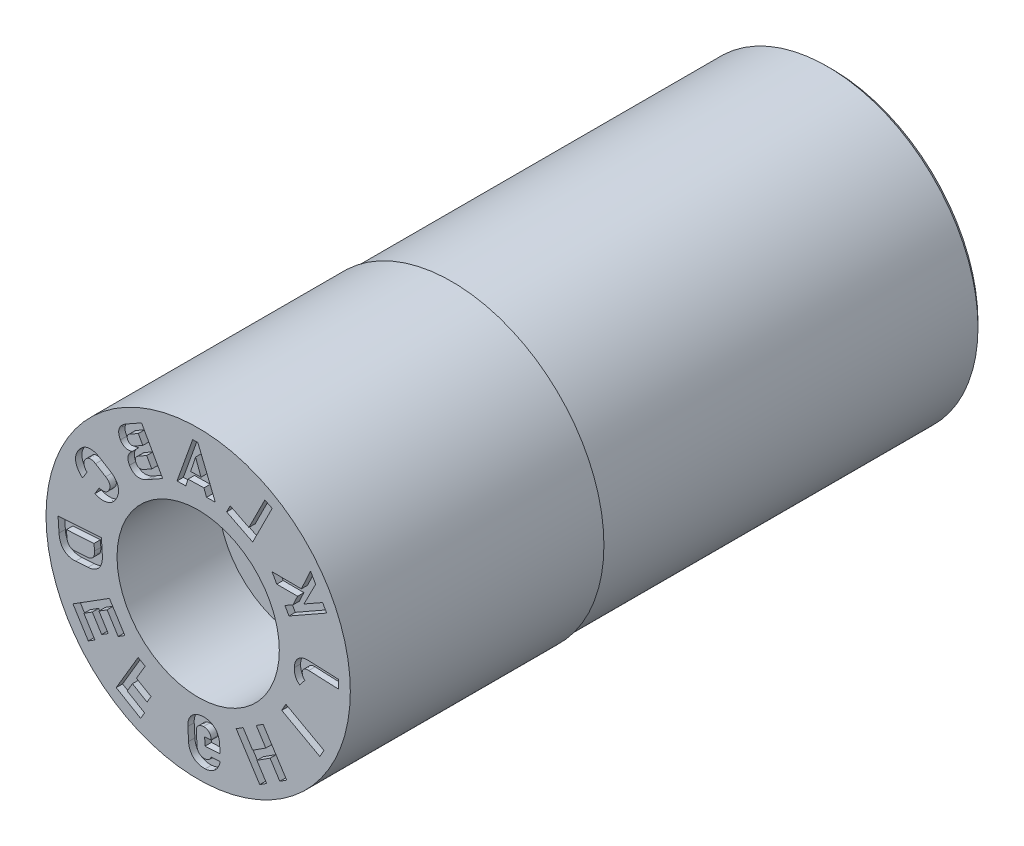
from build123d import *

# Parameters (mm, degrees)
SKETCH4_W          = 15
SKETCH4_H          = 1
CUT_EXTRUDE1_DEPTH = 0.25
CUT_EXTRUDE2_DEPTH = 3


with BuildPart() as part:
    # Sketch1 → Revolve1 (revolve)
    with BuildSketch(Plane(origin=(0, 0, 0), x_dir=(0, 0, -1), z_dir=(1, 0, 0)), mode=Mode.PRIVATE) as revolve1_sk:
        Polygon((0, 6), (0, 3.2), (4, 3.2), (4, 1.5), (19, 1.5), (19, 3), (25, 3), (25, 5.75), (24.75, 6), align=None)
    revolve(revolve1_sk.sketch.rotate(Axis((0, 0, 3.797909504), (0, 0, -1)), 90), axis=Axis((0, 0, 3.797909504), (0, 0, -1)))

    # Sketch4 → Cut-Revolve1 (revolve, cut)
    with BuildSketch(Plane(origin=(0, 0, 0), x_dir=(0, 0, -1), z_dir=(1, 0, 0)), mode=Mode.PRIVATE) as cut_revolve1_sk:
        with Locations((17.5, 6.435)):
            Rectangle(SKETCH4_W, SKETCH4_H)
    revolve(cut_revolve1_sk.sketch.rotate(Axis((0, 0, 0), (0, 0, -1)), 90), axis=Axis((0, 0, 0), (0, 0, -1)), mode=Mode.SUBTRACT)

    # Sketch2 → Cut-Extrude1 (cut)
    # profile 1 of 12: a face of its own
    with BuildSketch(Plane.XY):
        Polygon((4.171235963, 2.072474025), (4.632670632, 2.974470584), (4.432443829, 3.327050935), (4.068977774, 2.537599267), (2.91142221, 2.546631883), (3.099758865, 2.214166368), (3.918409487, 2.21056354), (3.742976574, 1.829521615), (3.421460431, 1.647124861), (3.580399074, 1.367185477), (5.066226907, 2.210098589), (4.907288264, 2.490037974), align=None)
    # profile 2 of 12: a face of its own
    with BuildSketch(Plane.XY):
        Polygon((2.919004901, 4.711078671), (2.629838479, 4.85616005), (2.000295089, 3.60091463), (1.262058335, 3.971177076), (1.122497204, 3.6926532), (2.149778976, 3.177320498), align=None)
    # profile 3 of 12: a face of its own
    with BuildSketch(Plane.XY):
        Polygon((-0.012626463, 5.495535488), (-0.216968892, 5.491201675), (-0.834872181, 3.76941146), (-0.488146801, 3.776648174), (-0.397957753, 4.052405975), (0.227855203, 4.065529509), (0.329584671, 3.793649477), (0.675962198, 3.80087229), align=None)
        Polygon((-0.103783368, 4.951859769), (0.112650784, 4.373422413), (-0.295767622, 4.364857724), align=None, mode=Mode.SUBTRACT)
    # profile 4 of 12: a face of its own
    with BuildSketch(Plane.XY):
        Polygon((-3.912099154, -2.210259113), (-3.589235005, -2.007294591), (-3.153470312, -2.70083517), (-2.891846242, -2.536452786), (-3.498099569, -1.571355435), (-4.938180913, -2.476644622), (-4.331927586, -3.441741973), (-4.070617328, -3.277208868), (-4.506301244, -2.583796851), (-4.173528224, -2.37460324), (-3.806145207, -2.95894143), (-3.544834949, -2.794408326), align=None)
    # profile 5 of 12: a face of its own
    with BuildSketch(Plane.XY):
        Polygon((-2.433475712, -3.764764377), (-2.089649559, -3.183480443), (-2.36563311, -3.020190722), (-3.231696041, -4.48438553), (-2.270028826, -5.05345174), (-2.112675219, -4.787761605), (-2.798554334, -4.381978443), (-2.590681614, -4.030541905), (-2.016031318, -4.370545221), (-1.85867771, -4.104855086), align=None)
    # profile 6 of 12: a face of its own
    with BuildSketch(Plane.XY):
        with BuildLine():
            Line((-2.231548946, 5.054885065), (-2.836814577, 4.715702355))
            add(Edge.make_bspline(
                [(-2.836814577, 4.715702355), (-2.881527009, 4.690780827), (-2.943919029, 4.649369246), (-3.014037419, 4.583020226), (-3.05637001, 4.532175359), (-3.090164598, 4.478758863), (-3.114796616, 4.423004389), (-3.129549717, 4.36504164), (-3.135593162, 4.305569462), (-3.131871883, 4.24461235), (-3.11476101, 4.15981132), (-3.087566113, 4.098808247), (-3.065583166, 4.059438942)],
                knots=[0, 0, 0, 0, 0.19478614, 0.282854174, 0.366198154, 0.445691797, 0.522430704, 0.596919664, 0.672178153, 0.748788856, 0.82822861, 1, 1, 1, 1], degree=3))
            add(Edge.make_bspline(
                [(-3.065583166, 4.059438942), (-3.049920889, 4.032193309), (-3.023998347, 3.99334859), (-2.980572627, 3.950707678), (-2.946117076, 3.924223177), (-2.90902032, 3.902816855), (-2.869576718, 3.886323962), (-2.827673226, 3.875808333), (-2.783939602, 3.869793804), (-2.73843244, 3.869502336), (-2.674271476, 3.876006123), (-2.626536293, 3.889389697), (-2.59493338, 3.900678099)],
                knots=[0, 0, 0, 0, 0.172796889, 0.253867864, 0.332914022, 0.410581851, 0.488200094, 0.566646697, 0.646913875, 0.729830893, 0.815675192, 1, 1, 1, 1], degree=3))
            add(Edge.make_bspline(
                [(-2.59493338, 3.900678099), (-2.623243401, 3.878917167), (-2.66312319, 3.844198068), (-2.704949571, 3.789627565), (-2.729933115, 3.747790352), (-2.749312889, 3.704323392), (-2.761626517, 3.659124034), (-2.76879309, 3.613088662), (-2.768488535, 3.565896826), (-2.762810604, 3.518029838), (-2.746096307, 3.452040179), (-2.724600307, 3.404453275), (-2.707211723, 3.373664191)],
                knots=[0, 0, 0, 0, 0.180057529, 0.263783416, 0.344958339, 0.424782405, 0.502382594, 0.580015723, 0.658446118, 0.739020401, 0.822028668, 1, 1, 1, 1], degree=3))
            Line((-2.707211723, 3.373664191), (-2.705647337, 3.370776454))
            add(Edge.make_bspline(
                [(-2.705647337, 3.370776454), (-2.683492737, 3.330814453), (-2.644963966, 3.275577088), (-2.581245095, 3.215719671), (-2.530512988, 3.18098542), (-2.476392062, 3.154440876), (-2.418734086, 3.137437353), (-2.358072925, 3.128888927), (-2.294584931, 3.129834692), (-2.228811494, 3.13936196), (-2.135617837, 3.165293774), (-2.067543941, 3.196577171), (-2.022928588, 3.221852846)],
                knots=[0, 0, 0, 0, 0.172848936, 0.252223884, 0.329273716, 0.404442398, 0.47914627, 0.55555657, 0.635161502, 0.718343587, 0.806128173, 1, 1, 1, 1], degree=3))
            Line((-2.022928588, 3.221852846), (-1.899889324, 3.290704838))
            Line((-1.899889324, 3.290704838), (-1.400164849, 3.570724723))
            Line((-1.400164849, 3.570724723), (-2.231548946, 5.054885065))
        make_face()
        with BuildLine():
            Line((-2.360287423, 4.628554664), (-2.181801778, 4.30992779))
            Line((-2.181801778, 4.30992779), (-2.498183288, 4.132759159))
            add(Edge.make_bspline(
                [(-2.498183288, 4.132759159), (-2.524319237, 4.119168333), (-2.564049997, 4.100617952), (-2.619427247, 4.096064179), (-2.657096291, 4.100369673), (-2.691999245, 4.113509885), (-2.736299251, 4.141648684), (-2.759911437, 4.175282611), (-2.773813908, 4.198572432)],
                knots=[0, 0, 0, 0, 0.277832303, 0.398607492, 0.514671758, 0.628814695, 0.743812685, 1, 1, 1, 1], degree=3))
            add(Edge.make_bspline(
                [(-2.773813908, 4.198572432), (-2.785815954, 4.220152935), (-2.799192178, 4.255079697), (-2.7983897, 4.303351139), (-2.789523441, 4.337520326), (-2.772527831, 4.369965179), (-2.73759582, 4.412250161), (-2.702543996, 4.437314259), (-2.676444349, 4.451511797)],
                knots=[0, 0, 0, 0, 0.243005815, 0.354161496, 0.466965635, 0.585007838, 0.709189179, 1, 1, 1, 1], degree=3))
            Line((-2.676444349, 4.451511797), (-2.360287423, 4.628554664))
        make_face(mode=Mode.SUBTRACT)
        with BuildLine():
            Line((-2.030890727, 4.040526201), (-1.830813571, 3.683354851))
            Line((-1.830813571, 3.683354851), (-2.147010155, 3.506289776))
            add(Edge.make_bspline(
                [(-2.147010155, 3.506289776), (-2.175901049, 3.491030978), (-2.219736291, 3.470925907), (-2.280467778, 3.464191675), (-2.321495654, 3.467907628), (-2.359493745, 3.480937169), (-2.406814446, 3.510485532), (-2.43265518, 3.545375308), (-2.446901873, 3.570249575)],
                knots=[0, 0, 0, 0, 0.283986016, 0.407341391, 0.52341818, 0.636508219, 0.750740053, 1, 1, 1, 1], degree=3))
            Line((-2.446901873, 3.570249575), (-2.448769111, 3.573308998))
            add(Edge.make_bspline(
                [(-2.448769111, 3.573308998), (-2.458678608, 3.590738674), (-2.470638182, 3.617780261), (-2.478355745, 3.655348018), (-2.479558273, 3.682171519), (-2.477062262, 3.708457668), (-2.470118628, 3.733882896), (-2.459410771, 3.758689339), (-2.444183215, 3.782263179), (-2.425316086, 3.804679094), (-2.394663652, 3.83443419), (-2.366589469, 3.852020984), (-2.347122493, 3.863441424)],
                knots=[0, 0, 0, 0, 0.172485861, 0.251675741, 0.32832506, 0.402454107, 0.477688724, 0.553908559, 0.633798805, 0.717922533, 0.805334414, 1, 1, 1, 1], degree=3))
            Line((-2.347122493, 3.863441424), (-2.030890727, 4.040526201))
        make_face(mode=Mode.SUBTRACT)
    # profile 7 of 12: a face of its own
    with BuildSketch(Plane.XY):
        Polygon((2.835349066, -3.861352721), (3.219001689, -4.458125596), (3.490828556, -4.28345078), (2.562903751, -2.840060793), (2.291076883, -3.014735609), (2.666885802, -3.599307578), (2.14862657, -3.932611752), (1.772751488, -3.347936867), (1.500461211, -3.52277794), (2.428386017, -4.966167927), (2.700676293, -4.791326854), (2.317089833, -4.194656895), align=None)
    # profile 8 of 12: a face of its own
    with BuildSketch(Plane.XY):
        with BuildLine():
            Line((-3.471225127, 2.792993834), (-3.872326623, 3.038529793))
            add(Edge.make_bspline(
                [(-3.872326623, 3.038529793), (-3.900080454, 3.055588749), (-3.942126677, 3.07898249), (-3.999518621, 3.105050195), (-4.04143091, 3.121388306), (-4.083057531, 3.134466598), (-4.12405598, 3.145669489), (-4.164883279, 3.152760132), (-4.205149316, 3.157508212), (-4.244897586, 3.159064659), (-4.284052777, 3.157887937), (-4.322537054, 3.154046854), (-4.360103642, 3.14682495), (-4.397019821, 3.137129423), (-4.433077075, 3.124424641), (-4.46866534, 3.109129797), (-4.503184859, 3.090499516), (-4.536971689, 3.069280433), (-4.569831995, 3.045451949), (-4.601482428, 3.018613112), (-4.631868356, 2.988801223), (-4.661326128, 2.956541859), (-4.699735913, 2.90902197), (-4.725843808, 2.870463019), (-4.742315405, 2.843527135)],
                knots=[0, 0, 0, 0, 0.096418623, 0.142170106, 0.186461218, 0.229442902, 0.271254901, 0.31212696, 0.351940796, 0.391171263, 0.429722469, 0.467793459, 0.505489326, 0.542812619, 0.580645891, 0.618521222, 0.657328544, 0.696599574, 0.736521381, 0.777345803, 0.819284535, 0.86241413, 0.906559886, 1, 1, 1, 1], degree=3))
            add(Edge.make_bspline(
                [(-4.742315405, 2.843527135), (-4.768682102, 2.79959471), (-4.802372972, 2.730938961), (-4.826695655, 2.633739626), (-4.835117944, 2.561452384), (-4.83396412, 2.488897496), (-4.823091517, 2.416648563), (-4.802083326, 2.345162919), (-4.771658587, 2.27457113), (-4.732103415, 2.20513599), (-4.664980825, 2.11260884), (-4.603115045, 2.050098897), (-4.558114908, 2.010712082)],
                knots=[0, 0, 0, 0, 0.164359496, 0.242522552, 0.319818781, 0.396757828, 0.474196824, 0.553044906, 0.634665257, 0.71980849, 0.808406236, 1, 1, 1, 1], degree=3))
            Line((-4.558114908, 2.010712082), (-4.383189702, 2.296693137))
            add(Edge.make_bspline(
                [(-4.383189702, 2.296693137), (-4.402545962, 2.31603803), (-4.430501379, 2.34537888), (-4.459626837, 2.389116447), (-4.477181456, 2.421419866), (-4.49005486, 2.45411298), (-4.500073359, 2.486532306), (-4.504572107, 2.519208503), (-4.505778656, 2.551509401), (-4.50296545, 2.583551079), (-4.492117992, 2.625877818), (-4.478612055, 2.656117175), (-4.466727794, 2.674951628)],
                knots=[0, 0, 0, 0, 0.195176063, 0.286539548, 0.373239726, 0.456219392, 0.536212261, 0.614027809, 0.690102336, 0.765907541, 0.841950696, 1, 1, 1, 1], degree=3))
            add(Edge.make_bspline(
                [(-4.466727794, 2.674951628), (-4.4522102, 2.699184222), (-4.42697976, 2.73215298), (-4.386619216, 2.767672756), (-4.355160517, 2.788289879), (-4.321508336, 2.803057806), (-4.286104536, 2.812374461), (-4.248970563, 2.816242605), (-4.210263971, 2.814805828), (-4.17055541, 2.807107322), (-4.114128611, 2.79050131), (-4.073900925, 2.768745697), (-4.047104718, 2.753018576)],
                knots=[0, 0, 0, 0, 0.174815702, 0.254583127, 0.331751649, 0.406600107, 0.480982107, 0.557388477, 0.636835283, 0.719715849, 0.807055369, 1, 1, 1, 1], degree=3))
            Line((-4.047104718, 2.753018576), (-3.646003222, 2.507482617))
            add(Edge.make_bspline(
                [(-3.646003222, 2.507482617), (-3.619463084, 2.49133468), (-3.582727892, 2.464471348), (-3.541581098, 2.422643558), (-3.51709236, 2.390569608), (-3.498216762, 2.357029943), (-3.48514265, 2.32215893), (-3.47753314, 2.28639686), (-3.475421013, 2.249668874), (-3.479206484, 2.212216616), (-3.492499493, 2.16001244), (-3.510957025, 2.122741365), (-3.525622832, 2.098600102)],
                knots=[0, 0, 0, 0, 0.192501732, 0.280291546, 0.362663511, 0.441768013, 0.517825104, 0.592476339, 0.667438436, 0.744799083, 0.824735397, 1, 1, 1, 1], degree=3))
            add(Edge.make_bspline(
                [(-3.525622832, 2.098600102), (-3.537547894, 2.079481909), (-3.557755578, 2.052569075), (-3.591275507, 2.023808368), (-3.618318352, 2.006052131), (-3.647681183, 1.992120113), (-3.678728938, 1.980984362), (-3.712015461, 1.975201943), (-3.746888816, 1.972289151), (-3.783420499, 1.973161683), (-3.835569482, 1.980396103), (-3.874446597, 1.991835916), (-3.900511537, 2.001109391)],
                knots=[0, 0, 0, 0, 0.160080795, 0.236116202, 0.312169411, 0.388723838, 0.466100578, 0.545220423, 0.627432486, 0.713976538, 0.803688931, 1, 1, 1, 1], degree=3))
            Line((-3.900511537, 2.001109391), (-4.075436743, 1.715128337))
            add(Edge.make_bspline(
                [(-4.075436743, 1.715128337), (-4.019537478, 1.693589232), (-3.935631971, 1.666969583), (-3.822590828, 1.649418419), (-3.74279981, 1.645903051), (-3.666092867, 1.650542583), (-3.593104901, 1.664474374), (-3.524008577, 1.687476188), (-3.459089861, 1.71915191), (-3.398249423, 1.759084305), (-3.323335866, 1.825515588), (-3.276543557, 1.885870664), (-3.249873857, 1.929716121)],
                knots=[0, 0, 0, 0, 0.192101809, 0.280672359, 0.365807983, 0.447541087, 0.526353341, 0.603189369, 0.680187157, 0.757177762, 0.835634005, 1, 1, 1, 1], degree=3))
            add(Edge.make_bspline(
                [(-3.249873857, 1.929716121), (-3.233538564, 1.956685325), (-3.210657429, 1.997381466), (-3.186343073, 2.053404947), (-3.170759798, 2.094241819), (-3.158425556, 2.134828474), (-3.148453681, 2.175079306), (-3.141951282, 2.215095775), (-3.138218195, 2.254813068), (-3.137667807, 2.293958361), (-3.139378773, 2.332519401), (-3.144744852, 2.370421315), (-3.15289797, 2.407673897), (-3.163733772, 2.444408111), (-3.177546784, 2.480397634), (-3.194014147, 2.515908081), (-3.213865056, 2.550423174), (-3.236167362, 2.584344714), (-3.261701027, 2.617018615), (-3.289836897, 2.64885442), (-3.320503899, 2.679803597), (-3.354002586, 2.709786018), (-3.403487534, 2.748855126), (-3.443106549, 2.776313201), (-3.471225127, 2.792993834)],
                knots=[0, 0, 0, 0, 0.093394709, 0.137866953, 0.180684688, 0.222705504, 0.263356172, 0.303339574, 0.342594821, 0.381331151, 0.419141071, 0.456735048, 0.494484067, 0.531939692, 0.569987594, 0.608497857, 0.6476809, 0.687739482, 0.728571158, 0.770310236, 0.813445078, 0.857467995, 0.903296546, 1, 1, 1, 1], degree=3))
        make_face()
    # profile 9 of 12: a face of its own
    with BuildSketch(Plane.XY):
        with BuildLine():
            Line((-4.830560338, -0.965853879), (-4.346314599, -0.933772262))
            add(Edge.make_bspline(
                [(-4.346314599, -0.933772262), (-4.316564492, -0.931691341), (-4.272596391, -0.926677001), (-4.215783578, -0.914612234), (-4.175145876, -0.904377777), (-4.136556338, -0.890383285), (-4.099205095, -0.875119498), (-4.063550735, -0.857322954), (-4.029608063, -0.837308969), (-3.997297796, -0.81520365), (-3.967203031, -0.790382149), (-3.939265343, -0.7633564), (-3.91274156, -0.734666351), (-3.889598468, -0.702735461), (-3.86739448, -0.669445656), (-3.847965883, -0.633405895), (-3.830143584, -0.595401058), (-3.814920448, -0.555025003), (-3.801825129, -0.512887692), (-3.791469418, -0.468802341), (-3.784008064, -0.422695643), (-3.778850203, -0.374523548), (-3.775022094, -0.306432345), (-3.776479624, -0.254329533), (-3.778985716, -0.219158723)],
                knots=[0, 0, 0, 0, 0.086430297, 0.127888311, 0.168207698, 0.207698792, 0.246675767, 0.285052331, 0.323012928, 0.360748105, 0.398340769, 0.435858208, 0.473304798, 0.511339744, 0.549952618, 0.589150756, 0.629809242, 0.671473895, 0.714040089, 0.757555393, 0.802536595, 0.849254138, 0.897843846, 1, 1, 1, 1], degree=3))
            Line((-3.778985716, -0.219158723), (-3.816054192, 0.344847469))
            Line((-3.816054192, 0.344847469), (-5.524383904, 0.232175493))
            Line((-5.524383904, 0.232175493), (-5.487177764, -0.332865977))
            add(Edge.make_bspline(
                [(-5.487177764, -0.332865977), (-5.484987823, -0.367281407), (-5.479590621, -0.417919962), (-5.467663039, -0.483495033), (-5.456504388, -0.529577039), (-5.443776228, -0.573651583), (-5.428675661, -0.615621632), (-5.411560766, -0.655515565), (-5.391956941, -0.693031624), (-5.371035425, -0.728604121), (-5.347345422, -0.761376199), (-5.322462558, -0.792299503), (-5.294832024, -0.820251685), (-5.265946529, -0.846361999), (-5.234855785, -0.869671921), (-5.202097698, -0.89080954), (-5.167242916, -0.909274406), (-5.130732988, -0.925478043), (-5.092560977, -0.939165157), (-5.052748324, -0.94984932), (-5.011444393, -0.958585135), (-4.968404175, -0.964385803), (-4.90793032, -0.968661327), (-4.861712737, -0.967627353), (-4.830560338, -0.965853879)],
                knots=[0, 0, 0, 0, 0.099740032, 0.147123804, 0.192678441, 0.236825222, 0.279748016, 0.321610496, 0.362273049, 0.402114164, 0.440851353, 0.479133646, 0.516792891, 0.554399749, 0.591662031, 0.629051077, 0.667054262, 0.705622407, 0.744501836, 0.784211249, 0.824761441, 0.866533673, 0.909715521, 1, 1, 1, 1], degree=3))
        make_face()
        with BuildLine():
            Line((-4.104983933, 0.002370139), (-4.088414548, -0.248012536))
            add(Edge.make_bspline(
                [(-4.088414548, -0.248012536), (-4.087089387, -0.27299956), (-4.086187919, -0.309680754), (-4.091667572, -0.356970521), (-4.097787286, -0.389417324), (-4.106323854, -0.419937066), (-4.11769528, -0.448333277), (-4.131876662, -0.474511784), (-4.148400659, -0.498663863), (-4.167288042, -0.520353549), (-4.187967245, -0.540027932), (-4.211344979, -0.556377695), (-4.236680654, -0.570356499), (-4.264253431, -0.581782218), (-4.304863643, -0.593736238), (-4.337060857, -0.598604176), (-4.359125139, -0.599733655)],
                knots=[0, 0, 0, 0, 0.149070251, 0.217385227, 0.282879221, 0.345337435, 0.405621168, 0.464448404, 0.522126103, 0.579343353, 0.635280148, 0.691484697, 0.748535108, 0.807147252, 0.868663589, 1, 1, 1, 1], degree=3))
            Line((-4.359125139, -0.599733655), (-4.86218944, -0.632912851))
            add(Edge.make_bspline(
                [(-4.86218944, -0.632912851), (-4.884177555, -0.63441477), (-4.916821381, -0.634467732), (-4.958517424, -0.627204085), (-4.987595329, -0.620235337), (-5.01430721, -0.608964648), (-5.039629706, -0.595881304), (-5.06300877, -0.579457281), (-5.084413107, -0.560174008), (-5.103999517, -0.538512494), (-5.120811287, -0.514027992), (-5.136140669, -0.487645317), (-5.148597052, -0.458489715), (-5.159185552, -0.427266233), (-5.169789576, -0.38090437), (-5.175082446, -0.34472264), (-5.176374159, -0.319633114)],
                knots=[0, 0, 0, 0, 0.131403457, 0.192788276, 0.251650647, 0.308869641, 0.364824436, 0.421034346, 0.478336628, 0.535991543, 0.594369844, 0.654771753, 0.717284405, 0.782701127, 0.850730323, 1, 1, 1, 1], degree=3))
            Line((-5.176374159, -0.319633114), (-5.192934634, -0.06938507))
            Line((-5.192934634, -0.06938507), (-4.104983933, 0.002370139))
        make_face(mode=Mode.SUBTRACT)
    # profile 10 of 12: a face of its own
    with BuildSketch(Plane.XY):
        with BuildLine():
            Line((0.863629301, -4.699665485), (0.845775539, -4.365965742))
            add(Edge.make_bspline(
                [(0.845775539, -4.365965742), (0.843665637, -4.335186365), (0.839692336, -4.289574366), (0.82812439, -4.230529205), (0.817373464, -4.18836289), (0.804353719, -4.147680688), (0.788984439, -4.108514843), (0.771320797, -4.070965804), (0.751333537, -4.035058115), (0.729258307, -4.000935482), (0.704942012, -3.969022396), (0.679409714, -3.938698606), (0.651377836, -3.911058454), (0.6215905, -3.885483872), (0.589758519, -3.862462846), (0.556516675, -3.840888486), (0.521062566, -3.822177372), (0.484201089, -3.80547175), (0.445913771, -3.79122108), (0.406236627, -3.77989069), (0.365487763, -3.770356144), (0.323318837, -3.764036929), (0.264750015, -3.759092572), (0.220061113, -3.758411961), (0.189992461, -3.760439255)],
                knots=[0, 0, 0, 0, 0.092114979, 0.136277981, 0.1793654, 0.221873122, 0.26362554, 0.304798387, 0.345574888, 0.386143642, 0.42592481, 0.465205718, 0.504301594, 0.543231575, 0.582216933, 0.621416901, 0.66136043, 0.701681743, 0.742093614, 0.783108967, 0.824710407, 0.866861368, 0.910181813, 1, 1, 1, 1], degree=3))
            add(Edge.make_bspline(
                [(0.189992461, -3.760439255), (0.15979978, -3.762527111), (0.114967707, -3.766323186), (0.057022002, -3.77795615), (0.015576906, -3.788109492), (-0.024292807, -3.800834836), (-0.062711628, -3.815701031), (-0.099676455, -3.833044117), (-0.135045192, -3.852508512), (-0.168725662, -3.873989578), (-0.200295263, -3.897348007), (-0.229894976, -3.922271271), (-0.257213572, -3.949249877), (-0.28224657, -3.978211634), (-0.305149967, -4.008971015), (-0.326482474, -4.041145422), (-0.344820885, -4.075476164), (-0.361575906, -4.11103179), (-0.375213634, -4.148196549), (-0.387160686, -4.186336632), (-0.395624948, -4.225904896), (-0.40245796, -4.266400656), (-0.40699981, -4.323046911), (-0.407428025, -4.366183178), (-0.405679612, -4.395323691)],
                knots=[0, 0, 0, 0, 0.092698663, 0.137285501, 0.180720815, 0.223200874, 0.265242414, 0.306681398, 0.34803511, 0.388686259, 0.428814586, 0.468112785, 0.50698522, 0.546164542, 0.585119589, 0.624268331, 0.664152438, 0.704099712, 0.744433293, 0.78518356, 0.826278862, 0.86813407, 0.910753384, 1, 1, 1, 1], degree=3))
            Line((-0.405679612, -4.395323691), (-0.378924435, -4.899198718))
            add(Edge.make_bspline(
                [(-0.378924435, -4.899198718), (-0.376814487, -4.929978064), (-0.372841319, -4.975590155), (-0.361273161, -5.034635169), (-0.350522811, -5.076801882), (-0.337500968, -5.117482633), (-0.322139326, -5.156653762), (-0.304447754, -5.194183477), (-0.284613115, -5.23007216), (-0.262259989, -5.263803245), (-0.238556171, -5.296056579), (-0.21264372, -5.325965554), (-0.184530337, -5.353481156), (-0.154703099, -5.378830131), (-0.123353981, -5.402655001), (-0.089707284, -5.423779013), (-0.054264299, -5.442666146), (-0.017381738, -5.459353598), (0.020914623, -5.473541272), (0.060358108, -5.485095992), (0.101291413, -5.493583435), (0.143187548, -5.500501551), (0.201794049, -5.50552758), (0.246361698, -5.505416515), (0.276410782, -5.503719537)],
                knots=[0, 0, 0, 0, 0.092189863, 0.136388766, 0.179511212, 0.22205349, 0.263839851, 0.305046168, 0.345855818, 0.386150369, 0.425784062, 0.465296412, 0.504157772, 0.5431194, 0.582111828, 0.621616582, 0.661592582, 0.701946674, 0.742391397, 0.783440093, 0.824531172, 0.867138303, 0.910153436, 1, 1, 1, 1], degree=3))
            add(Edge.make_bspline(
                [(0.276410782, -5.503719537), (0.325775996, -5.501276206), (0.398569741, -5.489331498), (0.490965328, -5.458433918), (0.555422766, -5.427099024), (0.61541432, -5.389072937), (0.670388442, -5.344793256), (0.719168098, -5.293690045), (0.762332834, -5.237004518), (0.798980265, -5.175014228), (0.838527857, -5.085231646), (0.856360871, -5.013014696), (0.863502, -4.963763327)],
                knots=[0, 0, 0, 0, 0.170730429, 0.253555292, 0.336068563, 0.417894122, 0.498687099, 0.579504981, 0.661559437, 0.744542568, 0.827905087, 1, 1, 1, 1], degree=3))
            Line((0.863502, -4.963763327), (0.515875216, -4.982275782))
            add(Edge.make_bspline(
                [(0.515875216, -4.982275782), (0.510764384, -5.000046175), (0.501187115, -5.026432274), (0.480766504, -5.0574078), (0.463453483, -5.079195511), (0.443188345, -5.098548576), (0.420893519, -5.115825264), (0.396874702, -5.131091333), (0.371155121, -5.144248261), (0.344012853, -5.154259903), (0.30684666, -5.165268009), (0.277898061, -5.168777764), (0.258557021, -5.170019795)],
                knots=[0, 0, 0, 0, 0.163544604, 0.24436254, 0.326081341, 0.408335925, 0.490615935, 0.574313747, 0.65882608, 0.744664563, 0.828910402, 1, 1, 1, 1], degree=3))
            add(Edge.make_bspline(
                [(0.258557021, -5.170019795), (0.231533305, -5.171452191), (0.191384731, -5.16942008), (0.140582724, -5.156189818), (0.105642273, -5.141698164), (0.073642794, -5.122354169), (0.044881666, -5.098812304), (0.019918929, -5.070919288), (-0.001816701, -5.039376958), (-0.019371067, -5.004080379), (-0.038096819, -4.951964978), (-0.043816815, -4.909900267), (-0.045571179, -4.881378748)],
                knots=[0, 0, 0, 0, 0.172157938, 0.253142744, 0.332680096, 0.41175775, 0.489998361, 0.568043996, 0.648934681, 0.732771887, 0.817932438, 1, 1, 1, 1], degree=3))
            Line((-0.045571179, -4.881378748), (-0.072326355, -4.377503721))
            add(Edge.make_bspline(
                [(-0.072326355, -4.377503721), (-0.074118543, -4.352166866), (-0.0713852, -4.314633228), (-0.058422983, -4.267066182), (-0.044002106, -4.234537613), (-0.0255291, -4.204468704), (-0.002771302, -4.177637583), (0.02399323, -4.15408198), (0.054831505, -4.134400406), (0.088869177, -4.118242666), (0.139457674, -4.101094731), (0.180187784, -4.096136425), (0.207846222, -4.094138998)],
                knots=[0, 0, 0, 0, 0.169495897, 0.249302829, 0.328489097, 0.406527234, 0.484422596, 0.562783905, 0.643966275, 0.728132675, 0.814123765, 1, 1, 1, 1], degree=3))
            add(Edge.make_bspline(
                [(0.207846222, -4.094138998), (0.235181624, -4.09284868), (0.275717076, -4.094399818), (0.327125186, -4.107107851), (0.362079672, -4.121262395), (0.3942364, -4.139383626), (0.422773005, -4.162343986), (0.447798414, -4.189348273), (0.469249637, -4.220428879), (0.486044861, -4.255442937), (0.504463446, -4.307796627), (0.509578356, -4.350396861), (0.511636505, -4.37931518)],
                knots=[0, 0, 0, 0, 0.174469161, 0.25602761, 0.336001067, 0.413903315, 0.490187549, 0.568212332, 0.647582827, 0.729648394, 0.814770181, 1, 1, 1, 1], degree=3))
            Line((0.511636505, -4.37931518), (0.51333417, -4.407481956))
            Line((0.51333417, -4.407481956), (0.2551599, -4.421467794))
            Line((0.2551599, -4.421467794), (0.271755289, -4.731505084))
            Line((0.271755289, -4.731505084), (0.863629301, -4.699665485))
        make_face()
    # profile 11 of 12: a face of its own
    with BuildSketch(Plane.XY):
        Polygon((3.456716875, -1.705591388), (3.295760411, -1.998808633), (4.797976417, -2.822650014), (4.958932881, -2.52943277), align=None)
    # profile 12 of 12: a face of its own
    with BuildSketch(Plane.XY):
        with BuildLine():
            Line((4.003769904, -0.772172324), (4.206264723, -0.517222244))
            add(Edge.make_bspline(
                [(4.206264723, -0.517222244), (4.189149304, -0.502990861), (4.166270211, -0.478606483), (4.141726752, -0.441773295), (4.126828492, -0.412388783), (4.115131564, -0.381905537), (4.104795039, -0.340129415), (4.102084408, -0.30804457), (4.103314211, -0.286717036)],
                knots=[0, 0, 0, 0, 0.255231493, 0.381315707, 0.506998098, 0.632722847, 0.755324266, 1, 1, 1, 1], degree=3))
            add(Edge.make_bspline(
                [(4.103314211, -0.286717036), (4.104495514, -0.258869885), (4.11281393, -0.21703202), (4.144032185, -0.171702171), (4.174331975, -0.144341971), (4.212104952, -0.123791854), (4.274476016, -0.105023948), (4.325625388, -0.101739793), (4.361056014, -0.103667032)],
                knots=[0, 0, 0, 0, 0.235578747, 0.34493456, 0.456480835, 0.57496348, 0.702365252, 1, 1, 1, 1], degree=3))
            Line((4.361056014, -0.103667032), (5.525258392, -0.153585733))
            Line((5.525258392, -0.153585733), (5.539598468, 0.179935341))
            Line((5.539598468, 0.179935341), (4.374008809, 0.229974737))
            add(Edge.make_bspline(
                [(4.374008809, 0.229974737), (4.318883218, 0.232794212), (4.238226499, 0.228682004), (4.136087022, 0.20622329), (4.079042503, 0.184881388), (4.036787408, 0.164051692), (4.007477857, 0.146152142), (3.979282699, 0.127218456), (3.953783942, 0.105326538), (3.929571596, 0.082237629), (3.906956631, 0.057248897), (3.886600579, 0.030005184), (3.867846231, 0.001099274), (3.85128874, -0.029637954), (3.836484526, -0.062068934), (3.823873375, -0.096154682), (3.812986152, -0.1318349), (3.804192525, -0.16924079), (3.794915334, -0.222270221), (3.79112183, -0.263180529), (3.789847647, -0.290895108)],
                knots=[0, 0, 0, 0, 0.185996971, 0.270621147, 0.351640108, 0.390621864, 0.429278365, 0.467346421, 0.504967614, 0.542395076, 0.580107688, 0.618424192, 0.65692399, 0.69616986, 0.736011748, 0.777014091, 0.81860016, 0.861698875, 0.906467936, 1, 1, 1, 1], degree=3))
            add(Edge.make_bspline(
                [(3.789847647, -0.290895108), (3.787773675, -0.34077662), (3.791701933, -0.41462874), (3.813248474, -0.50893691), (3.837446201, -0.573638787), (3.868484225, -0.633301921), (3.919486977, -0.704263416), (3.967846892, -0.748352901), (4.003769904, -0.772172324)],
                knots=[0, 0, 0, 0, 0.271973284, 0.400311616, 0.52557417, 0.647267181, 0.76561072, 1, 1, 1, 1], degree=3))
        make_face()
    extrude(amount=-CUT_EXTRUDE1_DEPTH, mode=Mode.SUBTRACT)

    # Sketch3 → Cut-Extrude2 (cut)
    with BuildSketch(Plane.XY.offset(-4)):
        Polygon((0.866025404, 1.5), (-0.866025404, 1.5), (-1.732050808, 0), (-0.866025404, -1.5), (0.866025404, -1.5), (1.732050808, 0), align=None)
    extrude(amount=-CUT_EXTRUDE2_DEPTH, mode=Mode.SUBTRACT)


solid = part.part
